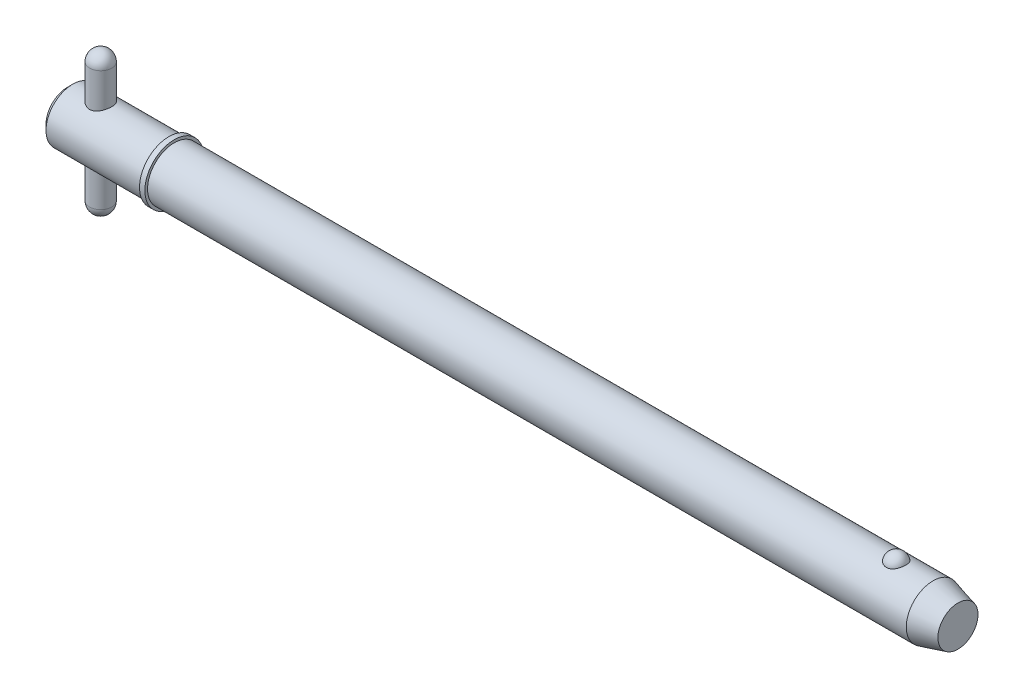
ISO-10303-21;
HEADER;
FILE_DESCRIPTION(('STEP AP214'),'2;1');
FILE_NAME('part.step','',(''),(''),'','','');
FILE_SCHEMA(('AUTOMOTIVE_DESIGN { 1 0 10303 214 1 1 1 1 }'));
ENDSEC;
DATA;
#1=APPLICATION_CONTEXT('core data for automotive mechanical design processes');
#2=APPLICATION_PROTOCOL_DEFINITION('international standard','automotive_design',2000,#1);
#3=PRODUCT_CONTEXT('',#1,'mechanical');
#4=PRODUCT('Part','Part','',(#3));
#5=PRODUCT_RELATED_PRODUCT_CATEGORY('part','',(#4));
#6=PRODUCT_DEFINITION_FORMATION('','',#4);
#7=PRODUCT_DEFINITION_CONTEXT('part definition',#1,'design');
#8=PRODUCT_DEFINITION('design','',#6,#7);
#9=PRODUCT_DEFINITION_SHAPE('','',#8);
#10=(LENGTH_UNIT() NAMED_UNIT(*) SI_UNIT(.MILLI.,.METRE.));
#11=(NAMED_UNIT(*) PLANE_ANGLE_UNIT() SI_UNIT($,.RADIAN.));
#12=(NAMED_UNIT(*) SI_UNIT($,.STERADIAN.) SOLID_ANGLE_UNIT());
#13=UNCERTAINTY_MEASURE_WITH_UNIT(LENGTH_MEASURE(1.E-05),#10,'distance_accuracy_value','');
#14=(GEOMETRIC_REPRESENTATION_CONTEXT(3) GLOBAL_UNCERTAINTY_ASSIGNED_CONTEXT((#13)) GLOBAL_UNIT_ASSIGNED_CONTEXT((#10,
#11,#12)) REPRESENTATION_CONTEXT('',''));
#15=CARTESIAN_POINT('',(0.,0.,0.));
#16=DIRECTION('',(0.,0.,1.));
#17=DIRECTION('',(1.,0.,0.));
#18=AXIS2_PLACEMENT_3D('',#15,#16,#17);
#19=CARTESIAN_POINT('',(5.94,12.7,0.));
#20=DIRECTION('',(0.,-1.,0.));
#21=DIRECTION('',(0.,0.,-1.));
#22=AXIS2_PLACEMENT_3D('',#19,#20,#21);
#23=CYLINDRICAL_SURFACE('',#22,1.98);
#24=CARTESIAN_POINT('',(5.94,-10.72,0.));
#25=DIRECTION('',(0.,-1.,0.));
#26=DIRECTION('',(0.,0.,-1.));
#27=AXIS2_PLACEMENT_3D('',#24,#25,#26);
#28=CIRCLE('',#27,1.98);
#29=CARTESIAN_POINT('',(5.94,-10.72,-1.98));
#30=VERTEX_POINT('',#29);
#31=EDGE_CURVE('P0_E10',#30,#30,#28,.F.);
#32=ORIENTED_EDGE('',*,*,#31,.T.);
#33=EDGE_LOOP('',(#32));
#34=FACE_BOUND('',#33,.T.);
#35=CARTESIAN_POINT('',(5.94,10.72,0.));
#36=DIRECTION('',(0.,-1.,0.));
#37=DIRECTION('',(0.,0.,-1.));
#38=AXIS2_PLACEMENT_3D('',#35,#36,#37);
#39=CIRCLE('',#38,1.98);
#40=CARTESIAN_POINT('',(5.94,10.72,-1.98));
#41=VERTEX_POINT('',#40);
#42=EDGE_CURVE('P0_E21',#41,#41,#39,.T.);
#43=ORIENTED_EDGE('',*,*,#42,.T.);
#44=EDGE_LOOP('',(#43));
#45=FACE_BOUND('',#44,.T.);
#46=ADVANCED_FACE('P0_F14',(#34,#45),#23,.T.);
#47=CARTESIAN_POINT('',(5.94,-10.72,0.));
#48=DIRECTION('',(0.,0.,1.));
#49=DIRECTION('',(1.,0.,0.));
#50=AXIS2_PLACEMENT_3D('',#47,#48,#49);
#51=SPHERICAL_SURFACE('',#50,1.98);
#52=CARTESIAN_POINT('',(5.94,-10.72,0.));
#53=DIRECTION('',(0.,-1.,0.));
#54=DIRECTION('',(0.,0.,-1.));
#55=AXIS2_PLACEMENT_3D('',#52,#53,#54);
#56=SPHERICAL_SURFACE('',#55,1.98);
#57=ORIENTED_EDGE('',*,*,#31,.F.);
#58=EDGE_LOOP('',(#57));
#59=FACE_BOUND('',#58,.T.);
#60=ADVANCED_FACE('P0_F29',(#59),#56,.T.);
#61=CARTESIAN_POINT('',(5.94,10.72,0.));
#62=DIRECTION('',(0.,0.,1.));
#63=DIRECTION('',(1.,0.,0.));
#64=AXIS2_PLACEMENT_3D('',#61,#62,#63);
#65=SPHERICAL_SURFACE('',#64,1.98);
#66=CARTESIAN_POINT('',(5.94,10.72,0.));
#67=DIRECTION('',(0.,-1.,0.));
#68=DIRECTION('',(0.,0.,-1.));
#69=AXIS2_PLACEMENT_3D('',#66,#67,#68);
#70=SPHERICAL_SURFACE('',#69,1.98);
#71=ORIENTED_EDGE('',*,*,#42,.F.);
#72=EDGE_LOOP('',(#71));
#73=FACE_BOUND('',#72,.T.);
#74=ADVANCED_FACE('P0_F16',(#73),#70,.T.);
#75=CLOSED_SHELL('',(#46,#60,#74));
#76=MANIFOLD_SOLID_BREP('P0_B1',#75);
#77=CARTESIAN_POINT('',(0.,0.,0.));
#78=DIRECTION('',(1.,0.,0.));
#79=DIRECTION('',(0.,0.,-1.));
#80=AXIS2_PLACEMENT_3D('',#77,#78,#79);
#81=CYLINDRICAL_SURFACE('',#80,4.765);
#82=CARTESIAN_POINT('',(154.304194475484,0.,0.));
#83=DIRECTION('',(1.,0.,0.));
#84=DIRECTION('',(0.,0.,-1.));
#85=AXIS2_PLACEMENT_3D('',#82,#83,#84);
#86=CIRCLE('',#85,4.765);
#87=CARTESIAN_POINT('',(154.304194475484,0.,-4.765));
#88=VERTEX_POINT('',#87);
#89=EDGE_CURVE('P1_E81',#88,#88,#86,.T.);
#90=ORIENTED_EDGE('',*,*,#89,.F.);
#91=EDGE_LOOP('',(#90));
#92=FACE_BOUND('',#91,.T.);
#93=CARTESIAN_POINT('',(19.05,0.,0.));
#94=DIRECTION('',(1.,0.,0.));
#95=DIRECTION('',(0.,0.,-1.));
#96=AXIS2_PLACEMENT_3D('',#93,#94,#95);
#97=CIRCLE('',#96,4.765);
#98=CARTESIAN_POINT('',(19.05,0.,-4.765));
#99=VERTEX_POINT('',#98);
#100=EDGE_CURVE('P1_E85',#99,#99,#97,.T.);
#101=ORIENTED_EDGE('',*,*,#100,.T.);
#102=EDGE_LOOP('',(#101));
#103=FACE_BOUND('',#102,.T.);
#104=CARTESIAN_POINT('',(147.751020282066,4.42764777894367,1.76101111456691));
#105=CARTESIAN_POINT('',(147.659721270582,4.42764470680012,1.76101422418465));
#106=CARTESIAN_POINT('',(147.568446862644,4.43059091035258,1.75366340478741));
#107=CARTESIAN_POINT('',(147.388615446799,4.44201846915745,1.72451180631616));
#108=CARTESIAN_POINT('',(147.300057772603,4.45049845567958,1.70271460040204));
#109=CARTESIAN_POINT('',(147.128257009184,4.47200516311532,1.64539370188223));
#110=CARTESIAN_POINT('',(147.045006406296,4.48502527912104,1.60988994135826));
#111=CARTESIAN_POINT('',(146.885763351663,4.51419542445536,1.52617873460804));
#112=CARTESIAN_POINT('',(146.809772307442,4.53034605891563,1.47796883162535));
#113=CARTESIAN_POINT('',(146.664744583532,4.56459317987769,1.36860494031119));
#114=CARTESIAN_POINT('',(146.595964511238,4.58273170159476,1.30712420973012));
#115=CARTESIAN_POINT('',(146.469342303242,4.61870302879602,1.17370204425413));
#116=CARTESIAN_POINT('',(146.411502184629,4.63653577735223,1.10175868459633));
#117=CARTESIAN_POINT('',(146.305570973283,4.67090140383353,0.945806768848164));
#118=CARTESIAN_POINT('',(146.258030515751,4.68734068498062,0.861402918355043));
#119=CARTESIAN_POINT('',(146.177081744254,4.71628466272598,0.685442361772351));
#120=CARTESIAN_POINT('',(146.143674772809,4.72878898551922,0.59388497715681));
#121=CARTESIAN_POINT('',(146.091287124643,4.74874061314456,0.404781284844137));
#122=CARTESIAN_POINT('',(146.072517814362,4.75611366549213,0.307168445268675));
#123=CARTESIAN_POINT('',(146.050584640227,4.76475393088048,0.109940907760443));
#124=CARTESIAN_POINT('',(146.047420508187,4.76602124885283,0.01032624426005));
#125=CARTESIAN_POINT('',(146.056740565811,4.76232928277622,-0.187629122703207));
#126=CARTESIAN_POINT('',(146.069158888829,4.7573962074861,-0.285973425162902));
#127=CARTESIAN_POINT('',(146.109280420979,4.74184975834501,-0.479027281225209));
#128=CARTESIAN_POINT('',(146.136983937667,4.73123627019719,-0.573736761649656));
#129=CARTESIAN_POINT('',(146.207158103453,4.70540026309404,-0.756973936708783));
#130=CARTESIAN_POINT('',(146.249646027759,4.69017235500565,-0.84549425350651));
#131=CARTESIAN_POINT('',(146.348520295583,4.6566986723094,-1.01378033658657));
#132=CARTESIAN_POINT('',(146.404907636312,4.63845268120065,-1.09354547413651));
#133=CARTESIAN_POINT('',(146.530552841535,4.6008543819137,-1.24228523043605));
#134=CARTESIAN_POINT('',(146.599843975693,4.58149930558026,-1.31123108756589));
#135=CARTESIAN_POINT('',(146.749606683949,4.54391653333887,-1.43607409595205));
#136=CARTESIAN_POINT('',(146.830077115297,4.52568872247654,-1.49197257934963));
#137=CARTESIAN_POINT('',(146.998150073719,4.49293007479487,-1.58786764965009));
#138=CARTESIAN_POINT('',(147.085544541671,4.47832346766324,-1.62820219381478));
#139=CARTESIAN_POINT('',(147.266553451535,4.45406011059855,-1.69345757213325));
#140=CARTESIAN_POINT('',(147.36016555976,4.44440151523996,-1.7183841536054));
#141=CARTESIAN_POINT('',(147.545893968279,4.43159888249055,-1.75112843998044));
#142=CARTESIAN_POINT('',(147.637849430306,4.42815213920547,-1.75974223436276));
#143=CARTESIAN_POINT('',(147.821965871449,4.42724735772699,-1.76201865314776));
#144=CARTESIAN_POINT('',(147.914126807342,4.42978816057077,-1.75568417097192));
#145=CARTESIAN_POINT('',(148.093129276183,4.44038648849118,-1.72869560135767));
#146=CARTESIAN_POINT('',(148.180047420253,4.44827555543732,-1.70847853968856));
#147=CARTESIAN_POINT('',(148.349131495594,4.46852246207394,-1.65479562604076));
#148=CARTESIAN_POINT('',(148.431297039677,4.48088066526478,-1.62132869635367));
#149=CARTESIAN_POINT('',(148.590591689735,4.50907357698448,-1.54120560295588));
#150=CARTESIAN_POINT('',(148.667570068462,4.52497884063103,-1.49427526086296));
#151=CARTESIAN_POINT('',(148.812708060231,4.55845148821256,-1.38881222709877));
#152=CARTESIAN_POINT('',(148.880865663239,4.57601924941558,-1.33027689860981));
#153=CARTESIAN_POINT('',(149.010099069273,4.61196537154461,-1.19991049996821));
#154=CARTESIAN_POINT('',(149.070656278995,4.63034074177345,-1.12756415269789));
#155=CARTESIAN_POINT('',(149.179279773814,4.66513959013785,-0.973612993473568));
#156=CARTESIAN_POINT('',(149.227343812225,4.68156271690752,-0.89200652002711));
#157=CARTESIAN_POINT('',(149.311383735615,4.71130224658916,-0.718892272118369));
#158=CARTESIAN_POINT('',(149.346918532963,4.724501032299,-0.627149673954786));
#159=CARTESIAN_POINT('',(149.402952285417,4.74571823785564,-0.438611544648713));
#160=CARTESIAN_POINT('',(149.423450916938,4.75373654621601,-0.341815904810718));
#161=CARTESIAN_POINT('',(149.449033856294,4.76378905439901,-0.145633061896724));
#162=CARTESIAN_POINT('',(149.454076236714,4.76580697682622,-0.0462395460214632));
#163=CARTESIAN_POINT('',(149.448523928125,4.76360573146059,0.152038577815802));
#164=CARTESIAN_POINT('',(149.437929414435,4.75938663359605,0.250923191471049));
#165=CARTESIAN_POINT('',(149.401387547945,4.74516937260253,0.445004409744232));
#166=CARTESIAN_POINT('',(149.375496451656,4.73519238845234,0.54021317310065));
#167=CARTESIAN_POINT('',(149.308927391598,4.7104939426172,0.724662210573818));
#168=CARTESIAN_POINT('',(149.268248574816,4.69577220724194,0.813902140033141));
#169=CARTESIAN_POINT('',(149.172717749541,4.6630376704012,0.984313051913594));
#170=CARTESIAN_POINT('',(149.117804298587,4.64501070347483,1.065446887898));
#171=CARTESIAN_POINT('',(148.995049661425,4.60764678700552,1.21692673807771));
#172=CARTESIAN_POINT('',(148.927208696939,4.5883098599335,1.28727293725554));
#173=CARTESIAN_POINT('',(148.780548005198,4.55060370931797,1.41479271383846));
#174=CARTESIAN_POINT('',(148.701791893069,4.53222967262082,1.47203785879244));
#175=CARTESIAN_POINT('',(148.534989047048,4.49849576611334,1.5721201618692));
#176=CARTESIAN_POINT('',(148.446941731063,4.48313608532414,1.61495641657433));
#177=CARTESIAN_POINT('',(148.259791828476,4.45676184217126,1.68642657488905));
#178=CARTESIAN_POINT('',(148.160365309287,4.44598302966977,1.71430590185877));
#179=CARTESIAN_POINT('',(147.957621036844,4.43142918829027,1.75159258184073));
#180=CARTESIAN_POINT('',(147.854304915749,4.42765125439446,1.76100759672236));
#181=CARTESIAN_POINT('',(147.751020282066,4.42764777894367,1.76101111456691));
#182=B_SPLINE_CURVE_WITH_KNOTS('',3,(#104,#105,#106,#107,#108,#109,#110,#111,#112,#113,#114,
#115,#116,#117,#118,#119,#120,#121,#122,#123,#124,#125,#126,#127,#128,#129,#130,#131,#132,#133,
#134,#135,#136,#137,#138,#139,#140,#141,#142,#143,#144,#145,#146,#147,#148,#149,#150,#151,#152,
#153,#154,#155,#156,#157,#158,#159,#160,#161,#162,#163,#164,#165,#166,#167,#168,#169,#170,#171,
#172,#173,#174,#175,#176,#177,#178,#179,#180,#181),.UNSPECIFIED.,.T.,.F.,(4,2,2,2,2,2,2,2,2,2,2,
2,2,2,2,2,2,2,2,2,2,2,2,2,2,2,2,2,2,2,2,2,2,2,2,2,2,2,4),(0.,0.273517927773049,
0.546968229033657,0.820022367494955,1.09312934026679,1.37393946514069,1.65480131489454,
1.94820420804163,2.24163496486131,2.53922817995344,2.83681628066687,3.13315071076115,
3.42949110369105,3.72617893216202,4.02288805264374,4.32037303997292,4.61782764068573,
4.90840095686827,5.19886582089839,5.4747485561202,5.75057789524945,6.01809977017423,
6.2856434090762,6.5590778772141,6.83257454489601,7.1196298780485,7.40673679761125,
7.7031266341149,7.99952284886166,8.29672237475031,8.59391856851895,8.89002850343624,
9.18615552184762,9.4835826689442,9.78100471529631,10.0767610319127,10.3725358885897,
10.6820893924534,10.9915144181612),.UNSPECIFIED.);
#183=CARTESIAN_POINT('',(147.751020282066,4.42764777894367,1.76101111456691));
#184=VERTEX_POINT('',#183);
#185=EDGE_CURVE('P1_E35',#184,#184,#182,.T.);
#186=ORIENTED_EDGE('',*,*,#185,.T.);
#187=EDGE_LOOP('',(#186));
#188=FACE_BOUND('',#187,.T.);
#189=ADVANCED_FACE('P1_F13',(#92,#103,#188),#81,.T.);
#190=CARTESIAN_POINT('',(0.,0.,0.));
#191=DIRECTION('',(-1.,0.,0.));
#192=DIRECTION('',(0.,0.,1.));
#193=AXIS2_PLACEMENT_3D('',#190,#191,#192);
#194=PLANE('',#193);
#195=CARTESIAN_POINT('',(0.,0.,0.));
#196=DIRECTION('',(1.,0.,0.));
#197=DIRECTION('',(0.,0.,-1.));
#198=AXIS2_PLACEMENT_3D('',#195,#196,#197);
#199=CIRCLE('',#198,3.812);
#200=CARTESIAN_POINT('',(0.,0.,-3.812));
#201=VERTEX_POINT('',#200);
#202=EDGE_CURVE('P1_E9',#201,#201,#199,.T.);
#203=ORIENTED_EDGE('',*,*,#202,.F.);
#204=EDGE_LOOP('',(#203));
#205=FACE_BOUND('',#204,.T.);
#206=ADVANCED_FACE('P1_F15',(#205),#194,.T.);
#207=CARTESIAN_POINT('',(0.952999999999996,0.,0.));
#208=DIRECTION('',(1.,0.,0.));
#209=DIRECTION('',(0.,0.,-1.));
#210=AXIS2_PLACEMENT_3D('',#207,#208,#209);
#211=CONICAL_SURFACE('',#210,4.765,0.78539816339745);
#212=ORIENTED_EDGE('',*,*,#202,.T.);
#213=EDGE_LOOP('',(#212));
#214=FACE_BOUND('',#213,.T.);
#215=CARTESIAN_POINT('',(0.952999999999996,0.,0.));
#216=DIRECTION('',(1.,0.,0.));
#217=DIRECTION('',(0.,0.,-1.));
#218=AXIS2_PLACEMENT_3D('',#215,#216,#217);
#219=CIRCLE('',#218,4.765);
#220=CARTESIAN_POINT('',(0.952999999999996,0.,-4.765));
#221=VERTEX_POINT('',#220);
#222=EDGE_CURVE('P1_E26',#221,#221,#219,.T.);
#223=ORIENTED_EDGE('',*,*,#222,.F.);
#224=EDGE_LOOP('',(#223));
#225=FACE_BOUND('',#224,.T.);
#226=ADVANCED_FACE('P1_F77',(#214,#225),#211,.T.);
#227=CARTESIAN_POINT('',(0.,0.,0.));
#228=DIRECTION('',(1.,0.,0.));
#229=DIRECTION('',(0.,0.,-1.));
#230=AXIS2_PLACEMENT_3D('',#227,#228,#229);
#231=CYLINDRICAL_SURFACE('',#230,4.765);
#232=CARTESIAN_POINT('',(5.94,-4.33414639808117,1.98));
#233=CARTESIAN_POINT('',(5.83435484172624,-4.33415447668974,1.97999169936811));
#234=CARTESIAN_POINT('',(5.72854887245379,-4.33806396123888,1.97149330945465));
#235=CARTESIAN_POINT('',(5.51998191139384,-4.35319906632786,1.93783487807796));
#236=CARTESIAN_POINT('',(5.41723000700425,-4.3644446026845,1.91262947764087));
#237=CARTESIAN_POINT('',(5.21817294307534,-4.39274225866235,1.84670269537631));
#238=CARTESIAN_POINT('',(5.12184344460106,-4.40977076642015,1.80604432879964));
#239=CARTESIAN_POINT('',(4.93740039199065,-4.44768106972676,1.71055160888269));
#240=CARTESIAN_POINT('',(4.84928487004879,-4.46856193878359,1.65572066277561));
#241=CARTESIAN_POINT('',(4.67826533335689,-4.51326966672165,1.52981120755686));
#242=CARTESIAN_POINT('',(4.59593118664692,-4.53719608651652,1.45799365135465));
#243=CARTESIAN_POINT('',(4.44405452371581,-4.58448035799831,1.30170177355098));
#244=CARTESIAN_POINT('',(4.37451692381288,-4.60783798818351,1.21722260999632));
#245=CARTESIAN_POINT('',(4.24730683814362,-4.65256187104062,1.03353484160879));
#246=CARTESIAN_POINT('',(4.19027484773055,-4.67379892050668,0.933848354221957));
#247=CARTESIAN_POINT('',(4.0940363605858,-4.7106711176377,0.7252544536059));
#248=CARTESIAN_POINT('',(4.05482199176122,-4.72630873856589,0.61635113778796));
#249=CARTESIAN_POINT('',(3.99739515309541,-4.74951416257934,0.398397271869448));
#250=CARTESIAN_POINT('',(3.97820018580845,-4.7574579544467,0.289646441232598));
#251=CARTESIAN_POINT('',(3.95818309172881,-4.76574596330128,0.0701967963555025));
#252=CARTESIAN_POINT('',(3.95735355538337,-4.76609324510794,-0.0405012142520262));
#253=CARTESIAN_POINT('',(3.9735743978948,-4.75937098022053,-0.253561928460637));
#254=CARTESIAN_POINT('',(3.98954548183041,-4.75274912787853,-0.356023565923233));
#255=CARTESIAN_POINT('',(4.03706504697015,-4.73344665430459,-0.556659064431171));
#256=CARTESIAN_POINT('',(4.06861467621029,-4.72076558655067,-0.654832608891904));
#257=CARTESIAN_POINT('',(4.14677192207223,-4.69032846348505,-0.845904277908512));
#258=CARTESIAN_POINT('',(4.19360181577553,-4.67249797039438,-0.938699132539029));
#259=CARTESIAN_POINT('',(4.30077315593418,-4.63350852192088,-1.11535616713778));
#260=CARTESIAN_POINT('',(4.3611193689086,-4.61234839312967,-1.19921518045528));
#261=CARTESIAN_POINT('',(4.49853487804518,-4.56707259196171,-1.3618711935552));
#262=CARTESIAN_POINT('',(4.57648039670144,-4.5428537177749,-1.43990029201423));
#263=CARTESIAN_POINT('',(4.74440779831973,-4.49530722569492,-1.58211009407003));
#264=CARTESIAN_POINT('',(4.83439425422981,-4.47197995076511,-1.64628551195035));
#265=CARTESIAN_POINT('',(5.02755026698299,-4.42812342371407,-1.76092221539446));
#266=CARTESIAN_POINT('',(5.13105348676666,-4.40770990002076,-1.81086937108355));
#267=CARTESIAN_POINT('',(5.34607555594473,-4.37336901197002,-1.89231211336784));
#268=CARTESIAN_POINT('',(5.45758864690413,-4.3594370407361,-1.92382080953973));
#269=CARTESIAN_POINT('',(5.67777275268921,-4.34077746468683,-1.96554536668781));
#270=CARTESIAN_POINT('',(5.78616167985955,-4.33551319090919,-1.9770057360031));
#271=CARTESIAN_POINT('',(6.00341835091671,-4.33325118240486,-1.98196183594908));
#272=CARTESIAN_POINT('',(6.11228591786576,-4.33625061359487,-1.97546372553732));
#273=CARTESIAN_POINT('',(6.32012423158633,-4.34962383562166,-1.94582288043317));
#274=CARTESIAN_POINT('',(6.41928436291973,-4.35951709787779,-1.92376364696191));
#275=CARTESIAN_POINT('',(6.61241543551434,-4.38495043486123,-1.86506038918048));
#276=CARTESIAN_POINT('',(6.70638516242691,-4.40049182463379,-1.82841296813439));
#277=CARTESIAN_POINT('',(6.89090272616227,-4.43627016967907,-1.73985559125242));
#278=CARTESIAN_POINT('',(6.98113841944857,-4.45667771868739,-1.68736639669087));
#279=CARTESIAN_POINT('',(7.1519532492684,-4.49964530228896,-1.56919282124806));
#280=CARTESIAN_POINT('',(7.232528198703,-4.52220626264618,-1.50350275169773));
#281=CARTESIAN_POINT('',(7.38851617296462,-4.56914071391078,-1.35452895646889));
#282=CARTESIAN_POINT('',(7.46298462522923,-4.5935132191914,-1.27025197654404));
#283=CARTESIAN_POINT('',(7.59689029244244,-4.63962841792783,-1.08983181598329));
#284=CARTESIAN_POINT('',(7.65632644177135,-4.66137092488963,-0.993687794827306));
#285=CARTESIAN_POINT('',(7.75840361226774,-4.69991192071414,-0.791608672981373));
#286=CARTESIAN_POINT('',(7.80100481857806,-4.71669866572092,-0.685651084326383));
#287=CARTESIAN_POINT('',(7.86746997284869,-4.74331408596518,-0.467197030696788));
#288=CARTESIAN_POINT('',(7.8913450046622,-4.75314687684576,-0.354704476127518));
#289=CARTESIAN_POINT('',(7.91828971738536,-4.76427543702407,-0.134819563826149));
#290=CARTESIAN_POINT('',(7.92269147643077,-4.76611762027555,-0.027616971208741));
#291=CARTESIAN_POINT('',(7.91414154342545,-4.76256684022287,0.185959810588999));
#292=CARTESIAN_POINT('',(7.90119286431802,-4.75717513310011,0.292334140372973));
#293=CARTESIAN_POINT('',(7.85926572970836,-4.74004856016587,0.497383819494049));
#294=CARTESIAN_POINT('',(7.83086647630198,-4.72854322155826,0.596198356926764));
#295=CARTESIAN_POINT('',(7.75947503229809,-4.70045111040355,0.787624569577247));
#296=CARTESIAN_POINT('',(7.71648006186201,-4.68386336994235,0.880235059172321));
#297=CARTESIAN_POINT('',(7.6149456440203,-4.64628321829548,1.06122875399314));
#298=CARTESIAN_POINT('',(7.55579211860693,-4.62512577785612,1.14923242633));
#299=CARTESIAN_POINT('',(7.42451813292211,-4.58091700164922,1.31443888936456));
#300=CARTESIAN_POINT('',(7.35239289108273,-4.5578649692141,1.39163767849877));
#301=CARTESIAN_POINT('',(7.19146107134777,-4.51050832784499,1.53847013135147));
#302=CARTESIAN_POINT('',(7.10185635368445,-4.48622440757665,1.60723941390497));
#303=CARTESIAN_POINT('',(6.91164948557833,-4.44076541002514,1.72888900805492));
#304=CARTESIAN_POINT('',(6.81104124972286,-4.41959206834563,1.78176046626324));
#305=CARTESIAN_POINT('',(6.60181953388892,-4.38318936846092,1.86953227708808));
#306=CARTESIAN_POINT('',(6.49325511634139,-4.3679267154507,1.90453365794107));
#307=CARTESIAN_POINT('',(6.32681512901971,-4.35102038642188,1.94268459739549));
#308=CARTESIAN_POINT('',(6.27079191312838,-4.34638447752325,1.953006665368));
#309=CARTESIAN_POINT('',(6.15793999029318,-4.33925923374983,1.96879053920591));
#310=CARTESIAN_POINT('',(6.10111188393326,-4.33676837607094,1.97425579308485));
#311=CARTESIAN_POINT('',(6.00947316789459,-4.33456308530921,1.97908711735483));
#312=CARTESIAN_POINT('',(5.97474528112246,-4.33414374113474,1.98000272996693));
#313=CARTESIAN_POINT('',(5.94,-4.33414639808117,1.98));
#314=B_SPLINE_CURVE_WITH_KNOTS('',3,(#232,#233,#234,#235,#236,#237,#238,#239,#240,#241,#242,
#243,#244,#245,#246,#247,#248,#249,#250,#251,#252,#253,#254,#255,#256,#257,#258,#259,#260,#261,
#262,#263,#264,#265,#266,#267,#268,#269,#270,#271,#272,#273,#274,#275,#276,#277,#278,#279,#280,
#281,#282,#283,#284,#285,#286,#287,#288,#289,#290,#291,#292,#293,#294,#295,#296,#297,#298,#299,
#300,#301,#302,#303,#304,#305,#306,#307,#308,#309,#310,#311,#312,#313),.UNSPECIFIED.,.T.,.F.,(4,
2,2,2,2,2,2,2,2,2,2,2,2,2,2,2,2,2,2,2,2,2,2,2,2,2,2,2,2,2,2,2,2,2,2,2,2,2,2,2,4),(0.,
0.316814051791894,0.634491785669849,0.950887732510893,1.2672076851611,1.60127705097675,
1.93547449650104,2.28407463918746,2.63252061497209,2.96292077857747,3.29318763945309,
3.60346227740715,3.91375978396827,4.22878888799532,4.54392926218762,4.88117914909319,
5.21855748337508,5.56691259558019,5.91501972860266,6.24062939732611,6.56612741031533,
6.87094948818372,7.17584258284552,7.49361276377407,7.81152017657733,8.15513975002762,
8.4987836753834,8.8432355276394,9.18748334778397,9.50777781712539,9.8280166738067,
10.1370037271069,10.4460496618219,10.7690461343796,11.0921619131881,11.4371238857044,
11.7822776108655,12.1254577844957,12.2967183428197,12.4678572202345,12.5720531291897),.UNSPECIFIED.);
#315=CARTESIAN_POINT('',(5.94,-4.33414639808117,1.98));
#316=VERTEX_POINT('',#315);
#317=EDGE_CURVE('P1_E17',#316,#316,#314,.T.);
#318=ORIENTED_EDGE('',*,*,#317,.F.);
#319=EDGE_LOOP('',(#318));
#320=FACE_BOUND('',#319,.T.);
#321=CARTESIAN_POINT('',(5.94,4.33414639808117,1.98));
#322=CARTESIAN_POINT('',(6.04564515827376,4.33415447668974,1.97999169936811));
#323=CARTESIAN_POINT('',(6.15145112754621,4.33806396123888,1.97149330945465));
#324=CARTESIAN_POINT('',(6.36001808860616,4.35319906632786,1.93783487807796));
#325=CARTESIAN_POINT('',(6.46276999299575,4.3644446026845,1.91262947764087));
#326=CARTESIAN_POINT('',(6.66182705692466,4.39274225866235,1.84670269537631));
#327=CARTESIAN_POINT('',(6.75815655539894,4.40977076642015,1.80604432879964));
#328=CARTESIAN_POINT('',(6.94259960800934,4.44768106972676,1.71055160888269));
#329=CARTESIAN_POINT('',(7.03071512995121,4.46856193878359,1.65572066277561));
#330=CARTESIAN_POINT('',(7.20173466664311,4.51326966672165,1.52981120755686));
#331=CARTESIAN_POINT('',(7.28406881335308,4.53719608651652,1.45799365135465));
#332=CARTESIAN_POINT('',(7.43594547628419,4.58448035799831,1.30170177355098));
#333=CARTESIAN_POINT('',(7.50548307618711,4.60783798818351,1.21722260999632));
#334=CARTESIAN_POINT('',(7.63269316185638,4.65256187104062,1.03353484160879));
#335=CARTESIAN_POINT('',(7.68972515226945,4.67379892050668,0.933848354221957));
#336=CARTESIAN_POINT('',(7.7859636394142,4.7106711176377,0.7252544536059));
#337=CARTESIAN_POINT('',(7.82517800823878,4.72630873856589,0.61635113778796));
#338=CARTESIAN_POINT('',(7.88260484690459,4.74951416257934,0.398397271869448));
#339=CARTESIAN_POINT('',(7.90179981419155,4.7574579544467,0.289646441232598));
#340=CARTESIAN_POINT('',(7.92181690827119,4.76574596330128,0.0701967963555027));
#341=CARTESIAN_POINT('',(7.92264644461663,4.76609324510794,-0.040501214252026));
#342=CARTESIAN_POINT('',(7.9064256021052,4.75937098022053,-0.253561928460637));
#343=CARTESIAN_POINT('',(7.89045451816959,4.75274912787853,-0.356023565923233));
#344=CARTESIAN_POINT('',(7.84293495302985,4.73344665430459,-0.55665906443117));
#345=CARTESIAN_POINT('',(7.81138532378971,4.72076558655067,-0.654832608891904));
#346=CARTESIAN_POINT('',(7.73322807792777,4.69032846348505,-0.845904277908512));
#347=CARTESIAN_POINT('',(7.68639818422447,4.67249797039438,-0.938699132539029));
#348=CARTESIAN_POINT('',(7.57922684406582,4.63350852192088,-1.11535616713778));
#349=CARTESIAN_POINT('',(7.5188806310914,4.61234839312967,-1.19921518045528));
#350=CARTESIAN_POINT('',(7.38146512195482,4.56707259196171,-1.3618711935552));
#351=CARTESIAN_POINT('',(7.30351960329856,4.5428537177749,-1.43990029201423));
#352=CARTESIAN_POINT('',(7.13559220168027,4.49530722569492,-1.58211009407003));
#353=CARTESIAN_POINT('',(7.04560574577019,4.47197995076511,-1.64628551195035));
#354=CARTESIAN_POINT('',(6.85244973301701,4.42812342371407,-1.76092221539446));
#355=CARTESIAN_POINT('',(6.74894651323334,4.40770990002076,-1.81086937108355));
#356=CARTESIAN_POINT('',(6.53392444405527,4.37336901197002,-1.89231211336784));
#357=CARTESIAN_POINT('',(6.42241135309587,4.3594370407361,-1.92382080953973));
#358=CARTESIAN_POINT('',(6.20222724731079,4.34077746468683,-1.96554536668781));
#359=CARTESIAN_POINT('',(6.09383832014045,4.33551319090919,-1.9770057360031));
#360=CARTESIAN_POINT('',(5.87658164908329,4.33325118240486,-1.98196183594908));
#361=CARTESIAN_POINT('',(5.76771408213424,4.33625061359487,-1.97546372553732));
#362=CARTESIAN_POINT('',(5.55987576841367,4.34962383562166,-1.94582288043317));
#363=CARTESIAN_POINT('',(5.46071563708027,4.35951709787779,-1.92376364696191));
#364=CARTESIAN_POINT('',(5.26758456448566,4.38495043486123,-1.86506038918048));
#365=CARTESIAN_POINT('',(5.17361483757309,4.40049182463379,-1.82841296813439));
#366=CARTESIAN_POINT('',(4.98909727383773,4.43627016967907,-1.73985559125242));
#367=CARTESIAN_POINT('',(4.89886158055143,4.45667771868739,-1.68736639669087));
#368=CARTESIAN_POINT('',(4.72804675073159,4.49964530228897,-1.56919282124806));
#369=CARTESIAN_POINT('',(4.647471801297,4.52220626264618,-1.50350275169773));
#370=CARTESIAN_POINT('',(4.49148382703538,4.56914071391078,-1.35452895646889));
#371=CARTESIAN_POINT('',(4.41701537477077,4.5935132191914,-1.27025197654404));
#372=CARTESIAN_POINT('',(4.28310970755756,4.63962841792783,-1.08983181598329));
#373=CARTESIAN_POINT('',(4.22367355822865,4.66137092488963,-0.993687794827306));
#374=CARTESIAN_POINT('',(4.12159638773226,4.69991192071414,-0.791608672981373));
#375=CARTESIAN_POINT('',(4.07899518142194,4.71669866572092,-0.685651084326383));
#376=CARTESIAN_POINT('',(4.01253002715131,4.74331408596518,-0.467197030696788));
#377=CARTESIAN_POINT('',(3.98865499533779,4.75314687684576,-0.354704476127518));
#378=CARTESIAN_POINT('',(3.96171028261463,4.76427543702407,-0.134819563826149));
#379=CARTESIAN_POINT('',(3.95730852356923,4.76611762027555,-0.0276169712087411));
#380=CARTESIAN_POINT('',(3.96585845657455,4.76256684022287,0.185959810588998));
#381=CARTESIAN_POINT('',(3.97880713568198,4.75717513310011,0.292334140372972));
#382=CARTESIAN_POINT('',(4.02073427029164,4.74004856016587,0.497383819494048));
#383=CARTESIAN_POINT('',(4.04913352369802,4.72854322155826,0.596198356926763));
#384=CARTESIAN_POINT('',(4.12052496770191,4.70045111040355,0.787624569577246));
#385=CARTESIAN_POINT('',(4.16351993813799,4.68386336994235,0.880235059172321));
#386=CARTESIAN_POINT('',(4.2650543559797,4.64628321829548,1.06122875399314));
#387=CARTESIAN_POINT('',(4.32420788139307,4.62512577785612,1.14923242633));
#388=CARTESIAN_POINT('',(4.45548186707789,4.58091700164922,1.31443888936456));
#389=CARTESIAN_POINT('',(4.52760710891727,4.5578649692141,1.39163767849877));
#390=CARTESIAN_POINT('',(4.68853892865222,4.51050832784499,1.53847013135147));
#391=CARTESIAN_POINT('',(4.77814364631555,4.48622440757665,1.60723941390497));
#392=CARTESIAN_POINT('',(4.96835051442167,4.44076541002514,1.72888900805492));
#393=CARTESIAN_POINT('',(5.06895875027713,4.41959206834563,1.78176046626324));
#394=CARTESIAN_POINT('',(5.27818046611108,4.38318936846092,1.86953227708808));
#395=CARTESIAN_POINT('',(5.38674488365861,4.3679267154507,1.90453365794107));
#396=CARTESIAN_POINT('',(5.55318487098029,4.35102038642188,1.94268459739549));
#397=CARTESIAN_POINT('',(5.60920808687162,4.34638447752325,1.953006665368));
#398=CARTESIAN_POINT('',(5.72206000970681,4.33925923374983,1.96879053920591));
#399=CARTESIAN_POINT('',(5.77888811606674,4.33676837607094,1.97425579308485));
#400=CARTESIAN_POINT('',(5.87052683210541,4.33456308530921,1.97908711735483));
#401=CARTESIAN_POINT('',(5.90525471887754,4.33414374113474,1.98000272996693));
#402=CARTESIAN_POINT('',(5.94,4.33414639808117,1.98));
#403=B_SPLINE_CURVE_WITH_KNOTS('',3,(#321,#322,#323,#324,#325,#326,#327,#328,#329,#330,#331,
#332,#333,#334,#335,#336,#337,#338,#339,#340,#341,#342,#343,#344,#345,#346,#347,#348,#349,#350,
#351,#352,#353,#354,#355,#356,#357,#358,#359,#360,#361,#362,#363,#364,#365,#366,#367,#368,#369,
#370,#371,#372,#373,#374,#375,#376,#377,#378,#379,#380,#381,#382,#383,#384,#385,#386,#387,#388,
#389,#390,#391,#392,#393,#394,#395,#396,#397,#398,#399,#400,#401,#402),.UNSPECIFIED.,.T.,.F.,(4,
2,2,2,2,2,2,2,2,2,2,2,2,2,2,2,2,2,2,2,2,2,2,2,2,2,2,2,2,2,2,2,2,2,2,2,2,2,2,2,4),(0.,
0.316814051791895,0.634491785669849,0.950887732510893,1.2672076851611,1.60127705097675,
1.93547449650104,2.28407463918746,2.63252061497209,2.96292077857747,3.29318763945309,
3.60346227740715,3.91375978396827,4.22878888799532,4.54392926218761,4.88117914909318,
5.21855748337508,5.56691259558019,5.91501972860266,6.24062939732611,6.56612741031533,
6.87094948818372,7.17584258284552,7.49361276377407,7.81152017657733,8.15513975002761,
8.4987836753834,8.84323552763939,9.18748334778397,9.50777781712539,9.8280166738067,
10.1370037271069,10.4460496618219,10.7690461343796,11.0921619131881,11.4371238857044,
11.7822776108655,12.1254577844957,12.2967183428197,12.4678572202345,12.5720531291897),.UNSPECIFIED.);
#404=CARTESIAN_POINT('',(5.94,4.33414639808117,1.98));
#405=VERTEX_POINT('',#404);
#406=EDGE_CURVE('P1_E43',#405,#405,#403,.T.);
#407=ORIENTED_EDGE('',*,*,#406,.F.);
#408=EDGE_LOOP('',(#407));
#409=FACE_BOUND('',#408,.T.);
#410=ORIENTED_EDGE('',*,*,#222,.T.);
#411=EDGE_LOOP('',(#410));
#412=FACE_BOUND('',#411,.T.);
#413=CARTESIAN_POINT('',(18.097,0.,0.));
#414=DIRECTION('',(1.,0.,0.));
#415=DIRECTION('',(0.,0.,-1.));
#416=AXIS2_PLACEMENT_3D('',#413,#414,#415);
#417=CIRCLE('',#416,4.765);
#418=CARTESIAN_POINT('',(18.097,0.,-4.765));
#419=VERTEX_POINT('',#418);
#420=EDGE_CURVE('P1_E31',#419,#419,#417,.T.);
#421=ORIENTED_EDGE('',*,*,#420,.F.);
#422=EDGE_LOOP('',(#421));
#423=FACE_BOUND('',#422,.T.);
#424=ADVANCED_FACE('P1_F103',(#320,#409,#412,#423),#231,.T.);
#425=CARTESIAN_POINT('',(18.097,4.765,0.));
#426=DIRECTION('',(-1.,0.,0.));
#427=DIRECTION('',(0.,0.,1.));
#428=AXIS2_PLACEMENT_3D('',#425,#426,#427);
#429=PLANE('',#428);
#430=ORIENTED_EDGE('',*,*,#420,.T.);
#431=EDGE_LOOP('',(#430));
#432=FACE_BOUND('',#431,.T.);
#433=CARTESIAN_POINT('',(18.097,0.,0.));
#434=DIRECTION('',(1.,0.,0.));
#435=DIRECTION('',(0.,0.,-1.));
#436=AXIS2_PLACEMENT_3D('',#433,#434,#435);
#437=CIRCLE('',#436,5.2415);
#438=CARTESIAN_POINT('',(18.097,0.,-5.2415));
#439=VERTEX_POINT('',#438);
#440=EDGE_CURVE('P1_E91',#439,#439,#437,.T.);
#441=ORIENTED_EDGE('',*,*,#440,.F.);
#442=EDGE_LOOP('',(#441));
#443=FACE_BOUND('',#442,.T.);
#444=ADVANCED_FACE('P1_F100',(#432,#443),#429,.T.);
#445=CARTESIAN_POINT('',(0.,0.,0.));
#446=DIRECTION('',(1.,0.,0.));
#447=DIRECTION('',(0.,0.,-1.));
#448=AXIS2_PLACEMENT_3D('',#445,#446,#447);
#449=CYLINDRICAL_SURFACE('',#448,5.2415);
#450=ORIENTED_EDGE('',*,*,#440,.T.);
#451=EDGE_LOOP('',(#450));
#452=FACE_BOUND('',#451,.T.);
#453=CARTESIAN_POINT('',(19.05,0.,0.));
#454=DIRECTION('',(1.,0.,0.));
#455=DIRECTION('',(0.,0.,-1.));
#456=AXIS2_PLACEMENT_3D('',#453,#454,#455);
#457=CIRCLE('',#456,5.2415);
#458=CARTESIAN_POINT('',(19.05,0.,-5.2415));
#459=VERTEX_POINT('',#458);
#460=EDGE_CURVE('P1_E88',#459,#459,#457,.T.);
#461=ORIENTED_EDGE('',*,*,#460,.F.);
#462=EDGE_LOOP('',(#461));
#463=FACE_BOUND('',#462,.T.);
#464=ADVANCED_FACE('P1_F68',(#452,#463),#449,.T.);
#465=CARTESIAN_POINT('',(19.05,5.2415,0.));
#466=DIRECTION('',(1.,0.,0.));
#467=DIRECTION('',(0.,0.,-1.));
#468=AXIS2_PLACEMENT_3D('',#465,#466,#467);
#469=PLANE('',#468);
#470=ORIENTED_EDGE('',*,*,#460,.T.);
#471=EDGE_LOOP('',(#470));
#472=FACE_BOUND('',#471,.T.);
#473=ORIENTED_EDGE('',*,*,#100,.F.);
#474=EDGE_LOOP('',(#473));
#475=FACE_BOUND('',#474,.T.);
#476=ADVANCED_FACE('P1_F62',(#472,#475),#469,.T.);
#477=CARTESIAN_POINT('',(158.75,0.,0.));
#478=DIRECTION('',(-1.,0.,0.));
#479=DIRECTION('',(0.,0.,1.));
#480=AXIS2_PLACEMENT_3D('',#477,#478,#479);
#481=CONICAL_SURFACE('',#480,3.57375000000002,0.261799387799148);
#482=ORIENTED_EDGE('',*,*,#89,.T.);
#483=EDGE_LOOP('',(#482));
#484=FACE_BOUND('',#483,.T.);
#485=CARTESIAN_POINT('',(158.75,0.,0.));
#486=DIRECTION('',(1.,0.,0.));
#487=DIRECTION('',(0.,0.,-1.));
#488=AXIS2_PLACEMENT_3D('',#485,#486,#487);
#489=CIRCLE('',#488,3.57375000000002);
#490=CARTESIAN_POINT('',(158.75,0.,-3.57375000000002));
#491=VERTEX_POINT('',#490);
#492=EDGE_CURVE('P1_E42',#491,#491,#489,.T.);
#493=ORIENTED_EDGE('',*,*,#492,.F.);
#494=EDGE_LOOP('',(#493));
#495=FACE_BOUND('',#494,.T.);
#496=ADVANCED_FACE('P1_F59',(#484,#495),#481,.T.);
#497=CARTESIAN_POINT('',(158.75,3.57375000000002,0.));
#498=DIRECTION('',(1.,0.,0.));
#499=DIRECTION('',(0.,0.,-1.));
#500=AXIS2_PLACEMENT_3D('',#497,#498,#499);
#501=PLANE('',#500);
#502=ORIENTED_EDGE('',*,*,#492,.T.);
#503=EDGE_LOOP('',(#502));
#504=FACE_BOUND('',#503,.T.);
#505=ADVANCED_FACE('P1_F55',(#504),#501,.T.);
#506=CARTESIAN_POINT('',(147.751020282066,4.2885,0.));
#507=DIRECTION('',(-1.,0.,0.));
#508=DIRECTION('',(0.,1.,0.));
#509=AXIS2_PLACEMENT_3D('',#506,#507,#508);
#510=SPHERICAL_SURFACE('',#509,1.76650000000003);
#511=ORIENTED_EDGE('',*,*,#185,.F.);
#512=EDGE_LOOP('',(#511));
#513=FACE_BOUND('',#512,.T.);
#514=ADVANCED_FACE('P1_F50',(#513),#510,.T.);
#515=CARTESIAN_POINT('',(5.94,-5.2415,0.));
#516=DIRECTION('',(0.,1.,0.));
#517=DIRECTION('',(0.,0.,1.));
#518=AXIS2_PLACEMENT_3D('',#515,#516,#517);
#519=CYLINDRICAL_SURFACE('',#518,1.98);
#520=ORIENTED_EDGE('',*,*,#317,.T.);
#521=EDGE_LOOP('',(#520));
#522=FACE_BOUND('',#521,.T.);
#523=ORIENTED_EDGE('',*,*,#406,.T.);
#524=EDGE_LOOP('',(#523));
#525=FACE_BOUND('',#524,.T.);
#526=ADVANCED_FACE('P1_F54',(#522,#525),#519,.F.);
#527=CLOSED_SHELL('',(#189,#206,#226,#424,#444,#464,#476,#496,#505,#514,#526));
#528=MANIFOLD_SOLID_BREP('P1_B1',#527);
#529=ADVANCED_BREP_SHAPE_REPRESENTATION('',(#18,#76,#528),#14);
#530=SHAPE_DEFINITION_REPRESENTATION(#9,#529);
ENDSEC;
END-ISO-10303-21;
